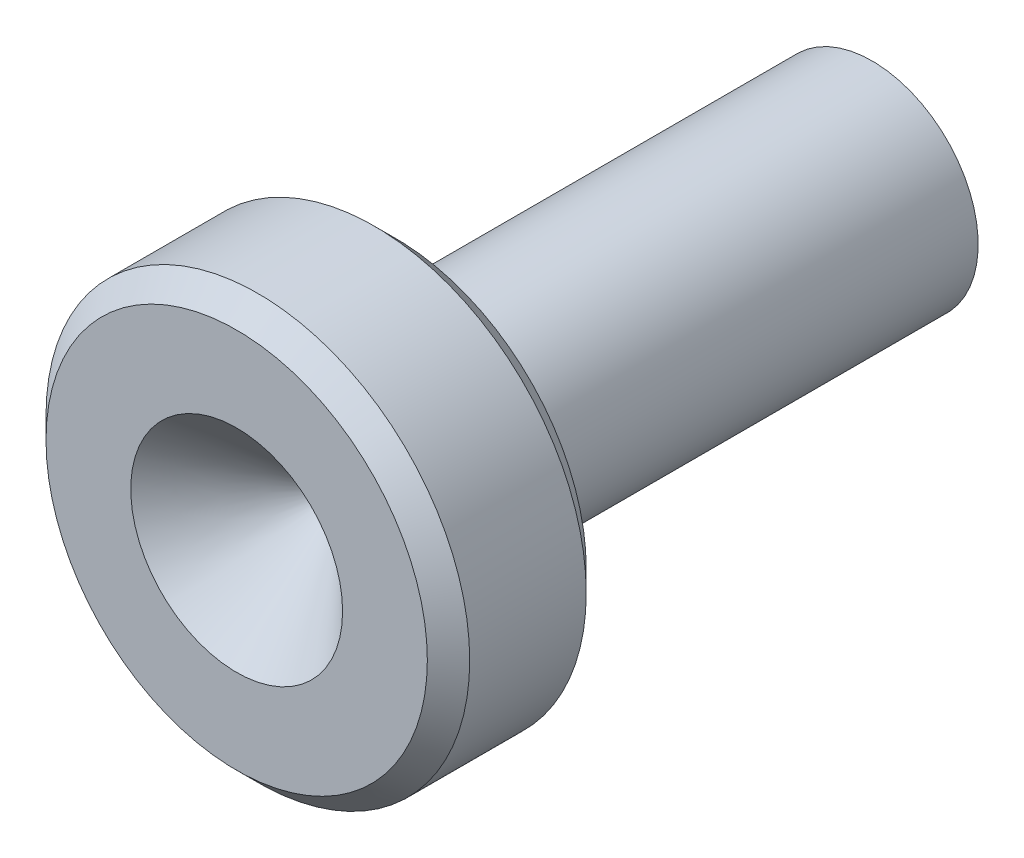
ISO-10303-21;
HEADER;
FILE_DESCRIPTION(('STEP AP214'),'2;1');
FILE_NAME('part.step','',(''),(''),'','','');
FILE_SCHEMA(('AUTOMOTIVE_DESIGN { 1 0 10303 214 1 1 1 1 }'));
ENDSEC;
DATA;
#1=APPLICATION_CONTEXT('core data for automotive mechanical design processes');
#2=APPLICATION_PROTOCOL_DEFINITION('international standard','automotive_design',2000,#1);
#3=PRODUCT_CONTEXT('',#1,'mechanical');
#4=PRODUCT('Part','Part','',(#3));
#5=PRODUCT_RELATED_PRODUCT_CATEGORY('part','',(#4));
#6=PRODUCT_DEFINITION_FORMATION('','',#4);
#7=PRODUCT_DEFINITION_CONTEXT('part definition',#1,'design');
#8=PRODUCT_DEFINITION('design','',#6,#7);
#9=PRODUCT_DEFINITION_SHAPE('','',#8);
#10=(LENGTH_UNIT() NAMED_UNIT(*) SI_UNIT(.MILLI.,.METRE.));
#11=(NAMED_UNIT(*) PLANE_ANGLE_UNIT() SI_UNIT($,.RADIAN.));
#12=(NAMED_UNIT(*) SI_UNIT($,.STERADIAN.) SOLID_ANGLE_UNIT());
#13=UNCERTAINTY_MEASURE_WITH_UNIT(LENGTH_MEASURE(1.E-05),#10,'distance_accuracy_value','');
#14=(GEOMETRIC_REPRESENTATION_CONTEXT(3) GLOBAL_UNCERTAINTY_ASSIGNED_CONTEXT((#13)) GLOBAL_UNIT_ASSIGNED_CONTEXT((#10,
#11,#12)) REPRESENTATION_CONTEXT('',''));
#15=CARTESIAN_POINT('',(0.,0.,0.));
#16=DIRECTION('',(0.,0.,1.));
#17=DIRECTION('',(1.,0.,0.));
#18=AXIS2_PLACEMENT_3D('',#15,#16,#17);
#19=CARTESIAN_POINT('',(0.,0.,5.));
#20=DIRECTION('',(0.,0.,1.));
#21=DIRECTION('',(1.,0.,0.));
#22=AXIS2_PLACEMENT_3D('',#19,#20,#21);
#23=CYLINDRICAL_SURFACE('',#22,10.);
#24=CARTESIAN_POINT('',(0.,0.,41.));
#25=DIRECTION('',(0.,0.,-1.));
#26=DIRECTION('',(-1.,0.,0.));
#27=AXIS2_PLACEMENT_3D('',#24,#25,#26);
#28=CIRCLE('',#27,10.);
#29=CARTESIAN_POINT('',(-10.,0.,41.));
#30=VERTEX_POINT('',#29);
#31=EDGE_CURVE('E71',#30,#30,#28,.T.);
#32=ORIENTED_EDGE('',*,*,#31,.T.);
#33=EDGE_LOOP('',(#32));
#34=FACE_BOUND('',#33,.T.);
#35=CARTESIAN_POINT('',(0.,0.,0.));
#36=DIRECTION('',(0.,0.,-1.));
#37=DIRECTION('',(-1.,0.,0.));
#38=AXIS2_PLACEMENT_3D('',#35,#36,#37);
#39=CIRCLE('',#38,10.);
#40=CARTESIAN_POINT('',(-10.,0.,0.));
#41=VERTEX_POINT('',#40);
#42=EDGE_CURVE('E66',#41,#41,#39,.T.);
#43=ORIENTED_EDGE('',*,*,#42,.F.);
#44=EDGE_LOOP('',(#43));
#45=FACE_BOUND('',#44,.T.);
#46=ADVANCED_FACE('F36',(#34,#45),#23,.T.);
#47=CARTESIAN_POINT('',(0.,0.,60.));
#48=DIRECTION('',(0.,0.,-1.));
#49=DIRECTION('',(1.,0.,0.));
#50=AXIS2_PLACEMENT_3D('',#47,#48,#49);
#51=CONICAL_SURFACE('',#50,1.5,0.0174532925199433);
#52=CARTESIAN_POINT('',(0.,0.,51.6458227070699));
#53=DIRECTION('',(0.,0.,1.));
#54=DIRECTION('',(1.,0.,0.));
#55=AXIS2_PLACEMENT_3D('',#52,#53,#54);
#56=CIRCLE('',#55,1.64582270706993);
#57=CARTESIAN_POINT('',(1.64582270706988,0.,51.6458227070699));
#58=VERTEX_POINT('',#57);
#59=EDGE_CURVE('E52',#58,#58,#56,.T.);
#60=ORIENTED_EDGE('',*,*,#59,.T.);
#61=EDGE_LOOP('',(#60));
#62=FACE_BOUND('',#61,.T.);
#63=CARTESIAN_POINT('',(0.,0.,0.));
#64=DIRECTION('',(0.,0.,-1.));
#65=DIRECTION('',(-1.,0.,0.));
#66=AXIS2_PLACEMENT_3D('',#63,#64,#65);
#67=CIRCLE('',#66,2.54730389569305);
#68=CARTESIAN_POINT('',(-2.54730389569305,0.,0.));
#69=VERTEX_POINT('',#68);
#70=EDGE_CURVE('E40',#69,#69,#67,.F.);
#71=ORIENTED_EDGE('',*,*,#70,.F.);
#72=EDGE_LOOP('',(#71));
#73=FACE_BOUND('',#72,.T.);
#74=ADVANCED_FACE('F88',(#62,#73),#51,.F.);
#75=CARTESIAN_POINT('',(0.,0.,60.));
#76=DIRECTION('',(0.,0.,1.));
#77=DIRECTION('',(1.,0.,0.));
#78=AXIS2_PLACEMENT_3D('',#75,#76,#77);
#79=PLANE('',#78);
#80=CARTESIAN_POINT('',(0.,0.,60.));
#81=DIRECTION('',(0.,0.,-1.));
#82=DIRECTION('',(-1.,0.,0.));
#83=AXIS2_PLACEMENT_3D('',#80,#81,#82);
#84=CIRCLE('',#83,10.);
#85=CARTESIAN_POINT('',(9.99999999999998,0.,60.));
#86=VERTEX_POINT('',#85);
#87=EDGE_CURVE('E55',#86,#86,#84,.T.);
#88=ORIENTED_EDGE('',*,*,#87,.T.);
#89=EDGE_LOOP('',(#88));
#90=FACE_BOUND('',#89,.T.);
#91=CARTESIAN_POINT('',(0.,0.,60.));
#92=DIRECTION('',(0.,0.,1.));
#93=DIRECTION('',(1.,0.,0.));
#94=AXIS2_PLACEMENT_3D('',#91,#92,#93);
#95=CIRCLE('',#94,18.);
#96=CARTESIAN_POINT('',(18.,0.,60.));
#97=VERTEX_POINT('',#96);
#98=EDGE_CURVE('E44',#97,#97,#95,.T.);
#99=ORIENTED_EDGE('',*,*,#98,.T.);
#100=EDGE_LOOP('',(#99));
#101=FACE_BOUND('',#100,.T.);
#102=ADVANCED_FACE('F101',(#90,#101),#79,.T.);
#103=CARTESIAN_POINT('',(0.,0.,45.));
#104=DIRECTION('',(0.,0.,-1.));
#105=DIRECTION('',(-1.,0.,0.));
#106=AXIS2_PLACEMENT_3D('',#103,#104,#105);
#107=PLANE('',#106);
#108=CARTESIAN_POINT('',(0.,0.,45.));
#109=DIRECTION('',(0.,0.,-1.));
#110=DIRECTION('',(-1.,0.,0.));
#111=AXIS2_PLACEMENT_3D('',#108,#109,#110);
#112=CIRCLE('',#111,14.);
#113=CARTESIAN_POINT('',(-14.,0.,45.));
#114=VERTEX_POINT('',#113);
#115=EDGE_CURVE('E49',#114,#114,#112,.F.);
#116=ORIENTED_EDGE('',*,*,#115,.T.);
#117=EDGE_LOOP('',(#116));
#118=FACE_BOUND('',#117,.T.);
#119=CARTESIAN_POINT('',(0.,0.,45.));
#120=DIRECTION('',(0.,0.,-1.));
#121=DIRECTION('',(-1.,0.,0.));
#122=AXIS2_PLACEMENT_3D('',#119,#120,#121);
#123=CIRCLE('',#122,18.);
#124=CARTESIAN_POINT('',(-18.,0.,45.));
#125=VERTEX_POINT('',#124);
#126=EDGE_CURVE('E59',#125,#125,#123,.T.);
#127=ORIENTED_EDGE('',*,*,#126,.T.);
#128=EDGE_LOOP('',(#127));
#129=FACE_BOUND('',#128,.T.);
#130=ADVANCED_FACE('F76',(#118,#129),#107,.T.);
#131=CARTESIAN_POINT('',(0.,0.,45.));
#132=DIRECTION('',(0.,0.,1.));
#133=DIRECTION('',(1.,0.,0.));
#134=AXIS2_PLACEMENT_3D('',#131,#132,#133);
#135=CYLINDRICAL_SURFACE('',#134,20.);
#136=CARTESIAN_POINT('',(0.,0.,58.));
#137=DIRECTION('',(0.,0.,1.));
#138=DIRECTION('',(1.,0.,0.));
#139=AXIS2_PLACEMENT_3D('',#136,#137,#138);
#140=CIRCLE('',#139,20.);
#141=CARTESIAN_POINT('',(20.,0.,58.));
#142=VERTEX_POINT('',#141);
#143=EDGE_CURVE('E10',#142,#142,#140,.F.);
#144=ORIENTED_EDGE('',*,*,#143,.T.);
#145=EDGE_LOOP('',(#144));
#146=FACE_BOUND('',#145,.T.);
#147=CARTESIAN_POINT('',(0.,0.,47.));
#148=DIRECTION('',(0.,0.,-1.));
#149=DIRECTION('',(-1.,0.,0.));
#150=AXIS2_PLACEMENT_3D('',#147,#148,#149);
#151=CIRCLE('',#150,20.);
#152=CARTESIAN_POINT('',(-20.,0.,47.));
#153=VERTEX_POINT('',#152);
#154=EDGE_CURVE('E54',#153,#153,#151,.F.);
#155=ORIENTED_EDGE('',*,*,#154,.T.);
#156=EDGE_LOOP('',(#155));
#157=FACE_BOUND('',#156,.T.);
#158=ADVANCED_FACE('F107',(#146,#157),#135,.T.);
#159=CARTESIAN_POINT('',(0.,0.,47.));
#160=DIRECTION('',(0.,0.,1.));
#161=DIRECTION('',(1.,0.,0.));
#162=AXIS2_PLACEMENT_3D('',#159,#160,#161);
#163=CONICAL_SURFACE('',#162,20.,0.785398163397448);
#164=ORIENTED_EDGE('',*,*,#126,.F.);
#165=EDGE_LOOP('',(#164));
#166=FACE_BOUND('',#165,.T.);
#167=ORIENTED_EDGE('',*,*,#154,.F.);
#168=EDGE_LOOP('',(#167));
#169=FACE_BOUND('',#168,.T.);
#170=ADVANCED_FACE('F82',(#166,#169),#163,.T.);
#171=CARTESIAN_POINT('',(0.,0.,41.));
#172=DIRECTION('',(0.,0.,-1.));
#173=DIRECTION('',(-1.,0.,0.));
#174=AXIS2_PLACEMENT_3D('',#171,#172,#173);
#175=TOROIDAL_SURFACE('',#174,14.,4.);
#176=ORIENTED_EDGE('',*,*,#115,.F.);
#177=EDGE_LOOP('',(#176));
#178=FACE_BOUND('',#177,.T.);
#179=ORIENTED_EDGE('',*,*,#31,.F.);
#180=EDGE_LOOP('',(#179));
#181=FACE_BOUND('',#180,.T.);
#182=ADVANCED_FACE('F79',(#178,#181),#175,.F.);
#183=CARTESIAN_POINT('',(0.,0.,60.));
#184=DIRECTION('',(0.,0.,-1.));
#185=DIRECTION('',(-1.,0.,0.));
#186=AXIS2_PLACEMENT_3D('',#183,#184,#185);
#187=CONICAL_SURFACE('',#186,18.,0.785398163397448);
#188=ORIENTED_EDGE('',*,*,#143,.F.);
#189=EDGE_LOOP('',(#188));
#190=FACE_BOUND('',#189,.T.);
#191=ORIENTED_EDGE('',*,*,#98,.F.);
#192=EDGE_LOOP('',(#191));
#193=FACE_BOUND('',#192,.T.);
#194=ADVANCED_FACE('F38',(#190,#193),#187,.T.);
#195=CARTESIAN_POINT('',(0.,0.,50.));
#196=DIRECTION('',(0.,0.,1.));
#197=DIRECTION('',(1.,0.,0.));
#198=AXIS2_PLACEMENT_3D('',#195,#196,#197);
#199=CONICAL_SURFACE('',#198,0.,0.785398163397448);
#200=CARTESIAN_POINT('',(9.99999999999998,0.,60.));
#201=CARTESIAN_POINT('',(9.91297731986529,0.,59.9129773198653));
#202=CARTESIAN_POINT('',(9.8259546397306,0.,59.8259546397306));
#203=CARTESIAN_POINT('',(9.65190927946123,0.,59.6519092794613));
#204=CARTESIAN_POINT('',(9.56488659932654,0.,59.5648865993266));
#205=CARTESIAN_POINT('',(9.39084123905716,0.,59.3908412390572));
#206=CARTESIAN_POINT('',(9.30381855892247,0.,59.3038185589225));
#207=CARTESIAN_POINT('',(9.12977319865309,0.,59.1297731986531));
#208=CARTESIAN_POINT('',(9.0427505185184,0.,59.0427505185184));
#209=CARTESIAN_POINT('',(8.86870515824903,0.,58.868705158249));
#210=CARTESIAN_POINT('',(8.78168247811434,0.,58.7816824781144));
#211=CARTESIAN_POINT('',(8.60763711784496,0.,58.607637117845));
#212=CARTESIAN_POINT('',(8.52061443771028,0.,58.5206144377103));
#213=CARTESIAN_POINT('',(8.3465690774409,0.,58.3465690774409));
#214=CARTESIAN_POINT('',(8.25954639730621,0.,58.2595463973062));
#215=CARTESIAN_POINT('',(8.08550103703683,0.,58.0855010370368));
#216=CARTESIAN_POINT('',(7.99847835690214,0.,57.9984783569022));
#217=CARTESIAN_POINT('',(7.82443299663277,0.,57.8244329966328));
#218=CARTESIAN_POINT('',(7.73741031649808,0.,57.7374103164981));
#219=CARTESIAN_POINT('',(7.5633649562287,0.,57.5633649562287));
#220=CARTESIAN_POINT('',(7.47634227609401,0.,57.476342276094));
#221=CARTESIAN_POINT('',(7.30229691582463,0.,57.3022969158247));
#222=CARTESIAN_POINT('',(7.21527423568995,0.,57.21527423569));
#223=CARTESIAN_POINT('',(7.04122887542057,0.,57.0412288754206));
#224=CARTESIAN_POINT('',(6.95420619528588,0.,56.9542061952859));
#225=CARTESIAN_POINT('',(6.7801608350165,0.,56.7801608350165));
#226=CARTESIAN_POINT('',(6.69313815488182,0.,56.6931381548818));
#227=CARTESIAN_POINT('',(6.51909279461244,0.,56.5190927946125));
#228=CARTESIAN_POINT('',(6.43207011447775,0.,56.4320701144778));
#229=CARTESIAN_POINT('',(6.25802475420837,0.,56.2580247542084));
#230=CARTESIAN_POINT('',(6.17100207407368,0.,56.1710020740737));
#231=CARTESIAN_POINT('',(5.99695671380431,0.,55.9969567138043));
#232=CARTESIAN_POINT('',(5.90993403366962,0.,55.9099340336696));
#233=CARTESIAN_POINT('',(5.73588867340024,0.,55.7358886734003));
#234=CARTESIAN_POINT('',(5.64886599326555,0.,55.6488659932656));
#235=CARTESIAN_POINT('',(5.47482063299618,0.,55.4748206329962));
#236=CARTESIAN_POINT('',(5.38779795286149,0.,55.3877979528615));
#237=CARTESIAN_POINT('',(5.21375259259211,0.,55.2137525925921));
#238=CARTESIAN_POINT('',(5.12672991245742,0.,55.1267299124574));
#239=CARTESIAN_POINT('',(4.95268455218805,0.,54.9526845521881));
#240=CARTESIAN_POINT('',(4.86566187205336,0.,54.8656618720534));
#241=CARTESIAN_POINT('',(4.69161651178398,0.,54.691616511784));
#242=CARTESIAN_POINT('',(4.60459383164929,0.,54.6045938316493));
#243=CARTESIAN_POINT('',(4.43054847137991,0.,54.4305484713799));
#244=CARTESIAN_POINT('',(4.34352579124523,0.,54.3435257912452));
#245=CARTESIAN_POINT('',(4.16948043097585,0.,54.1694804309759));
#246=CARTESIAN_POINT('',(4.08245775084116,0.,54.0824577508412));
#247=CARTESIAN_POINT('',(3.90841239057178,0.,53.9084123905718));
#248=CARTESIAN_POINT('',(3.8213897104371,0.,53.8213897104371));
#249=CARTESIAN_POINT('',(3.64734435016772,0.,53.6473443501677));
#250=CARTESIAN_POINT('',(3.56032167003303,0.,53.560321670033));
#251=CARTESIAN_POINT('',(3.38627630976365,0.,53.3862763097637));
#252=CARTESIAN_POINT('',(3.29925362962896,0.,53.299253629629));
#253=CARTESIAN_POINT('',(3.12520826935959,0.,53.1252082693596));
#254=CARTESIAN_POINT('',(3.0381855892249,0.,53.0381855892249));
#255=CARTESIAN_POINT('',(2.86414022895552,0.,52.8641402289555));
#256=CARTESIAN_POINT('',(2.77711754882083,0.,52.7771175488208));
#257=CARTESIAN_POINT('',(2.60307218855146,0.,52.6030721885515));
#258=CARTESIAN_POINT('',(2.51604950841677,0.,52.5160495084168));
#259=CARTESIAN_POINT('',(2.34200414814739,0.,52.3420041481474));
#260=CARTESIAN_POINT('',(2.2549814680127,0.,52.2549814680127));
#261=CARTESIAN_POINT('',(2.08093610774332,0.,52.0809361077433));
#262=CARTESIAN_POINT('',(1.99391342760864,0.,51.9939134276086));
#263=CARTESIAN_POINT('',(1.81986806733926,0.,51.8198680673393));
#264=CARTESIAN_POINT('',(1.73284538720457,0.,51.7328453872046));
#265=CARTESIAN_POINT('',(1.64582270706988,0.,51.6458227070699));
#266=B_SPLINE_CURVE_WITH_KNOTS('',3,(#200,#201,#202,#203,#204,#205,#206,#207,#208,#209,#210,
#211,#212,#213,#214,#215,#216,#217,#218,#219,#220,#221,#222,#223,#224,#225,#226,#227,#228,#229,
#230,#231,#232,#233,#234,#235,#236,#237,#238,#239,#240,#241,#242,#243,#244,#245,#246,#247,#248,
#249,#250,#251,#252,#253,#254,#255,#256,#257,#258,#259,#260,#261,#262,#263,#264,#265),
.UNSPECIFIED.,.F.,.F.,(4,2,2,2,2,2,2,2,2,2,2,2,2,2,2,2,2,2,2,2,2,2,2,2,2,2,2,2,2,2,2,2,4),(0.,
0.369205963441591,0.738411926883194,1.10761789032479,1.47682385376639,1.84602981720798,
2.21523578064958,2.58444174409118,2.95364770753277,3.32285367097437,3.69205963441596,
4.06126559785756,4.43047156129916,4.79967752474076,5.16888348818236,5.53808945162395,
5.90729541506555,6.27650137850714,6.64570734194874,7.01491330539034,7.38411926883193,
7.75332523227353,8.12253119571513,8.49173715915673,8.86094312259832,9.23014908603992,
9.59935504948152,9.96856101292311,10.3377669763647,10.7069729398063,11.0761789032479,
11.4453848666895,11.8145908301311),.UNSPECIFIED.);
#267=EDGE_CURVE('BSEAM96',#86,#58,#266,.T.);
#268=ORIENTED_EDGE('',*,*,#87,.F.);
#269=ORIENTED_EDGE('',*,*,#59,.F.);
#270=ORIENTED_EDGE('',*,*,#267,.T.);
#271=ORIENTED_EDGE('',*,*,#267,.F.);
#272=EDGE_LOOP('',(#268,#270,#269,#271));
#273=FACE_BOUND('',#272,.T.);
#274=ADVANCED_FACE('F96',(#273),#199,.F.);
#275=CARTESIAN_POINT('',(0.,0.,0.));
#276=DIRECTION('',(0.,0.,-1.));
#277=DIRECTION('',(-1.,0.,0.));
#278=AXIS2_PLACEMENT_3D('',#275,#276,#277);
#279=PLANE('',#278);
#280=ORIENTED_EDGE('',*,*,#42,.T.);
#281=EDGE_LOOP('',(#280));
#282=FACE_BOUND('',#281,.T.);
#283=ORIENTED_EDGE('',*,*,#70,.T.);
#284=EDGE_LOOP('',(#283));
#285=FACE_BOUND('',#284,.T.);
#286=ADVANCED_FACE('F93',(#282,#285),#279,.T.);
#287=CLOSED_SHELL('',(#46,#74,#102,#130,#158,#170,#182,#194,#274,#286));
#288=MANIFOLD_SOLID_BREP('B2',#287);
#289=ADVANCED_BREP_SHAPE_REPRESENTATION('',(#18,#288),#14);
#290=SHAPE_DEFINITION_REPRESENTATION(#9,#289);
ENDSEC;
END-ISO-10303-21;
